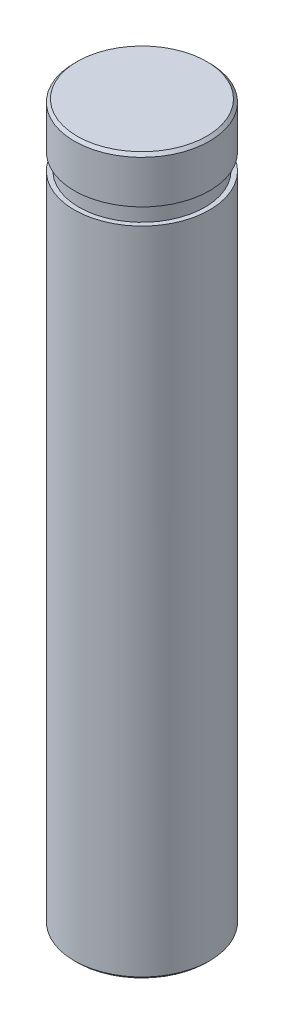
ISO-10303-21;
HEADER;
FILE_DESCRIPTION(('STEP AP214'),'2;1');
FILE_NAME('part.step','',(''),(''),'','','');
FILE_SCHEMA(('AUTOMOTIVE_DESIGN { 1 0 10303 214 1 1 1 1 }'));
ENDSEC;
DATA;
#1=APPLICATION_CONTEXT('core data for automotive mechanical design processes');
#2=APPLICATION_PROTOCOL_DEFINITION('international standard','automotive_design',2000,#1);
#3=PRODUCT_CONTEXT('',#1,'mechanical');
#4=PRODUCT('Part','Part','',(#3));
#5=PRODUCT_RELATED_PRODUCT_CATEGORY('part','',(#4));
#6=PRODUCT_DEFINITION_FORMATION('','',#4);
#7=PRODUCT_DEFINITION_CONTEXT('part definition',#1,'design');
#8=PRODUCT_DEFINITION('design','',#6,#7);
#9=PRODUCT_DEFINITION_SHAPE('','',#8);
#10=(LENGTH_UNIT() NAMED_UNIT(*) SI_UNIT(.MILLI.,.METRE.));
#11=(NAMED_UNIT(*) PLANE_ANGLE_UNIT() SI_UNIT($,.RADIAN.));
#12=(NAMED_UNIT(*) SI_UNIT($,.STERADIAN.) SOLID_ANGLE_UNIT());
#13=UNCERTAINTY_MEASURE_WITH_UNIT(LENGTH_MEASURE(1.E-05),#10,'distance_accuracy_value','');
#14=(GEOMETRIC_REPRESENTATION_CONTEXT(3) GLOBAL_UNCERTAINTY_ASSIGNED_CONTEXT((#13)) GLOBAL_UNIT_ASSIGNED_CONTEXT((#10,
#11,#12)) REPRESENTATION_CONTEXT('',''));
#15=CARTESIAN_POINT('',(0.,0.,0.));
#16=DIRECTION('',(0.,0.,1.));
#17=DIRECTION('',(1.,0.,0.));
#18=AXIS2_PLACEMENT_3D('',#15,#16,#17);
#19=CARTESIAN_POINT('',(0.,0.,0.));
#20=DIRECTION('',(0.,-1.,0.));
#21=DIRECTION('',(0.,0.,-1.));
#22=AXIS2_PLACEMENT_3D('',#19,#20,#21);
#23=PLANE('',#22);
#24=CARTESIAN_POINT('',(0.,0.,0.));
#25=DIRECTION('',(0.,-1.,0.));
#26=DIRECTION('',(0.,0.,-1.));
#27=AXIS2_PLACEMENT_3D('',#24,#25,#26);
#28=CIRCLE('',#27,2.873);
#29=CARTESIAN_POINT('',(0.,0.,-2.873));
#30=VERTEX_POINT('',#29);
#31=EDGE_CURVE('E41',#30,#30,#28,.T.);
#32=ORIENTED_EDGE('',*,*,#31,.T.);
#33=EDGE_LOOP('',(#32));
#34=FACE_BOUND('',#33,.T.);
#35=ADVANCED_FACE('F30',(#34),#23,.T.);
#36=CARTESIAN_POINT('',(0.,0.,0.));
#37=DIRECTION('',(0.,1.,0.));
#38=DIRECTION('',(0.,0.,1.));
#39=AXIS2_PLACEMENT_3D('',#36,#37,#38);
#40=CYLINDRICAL_SURFACE('',#39,3.);
#41=CARTESIAN_POINT('',(0.,0.127000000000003,0.));
#42=DIRECTION('',(0.,-1.,0.));
#43=DIRECTION('',(0.,0.,-1.));
#44=AXIS2_PLACEMENT_3D('',#41,#42,#43);
#45=CIRCLE('',#44,3.);
#46=CARTESIAN_POINT('',(0.,0.127000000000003,-3.));
#47=VERTEX_POINT('',#46);
#48=EDGE_CURVE('E45',#47,#47,#45,.F.);
#49=ORIENTED_EDGE('',*,*,#48,.T.);
#50=EDGE_LOOP('',(#49));
#51=FACE_BOUND('',#50,.T.);
#52=CARTESIAN_POINT('',(0.,28.9814,0.));
#53=DIRECTION('',(0.,1.,0.));
#54=DIRECTION('',(0.,0.,1.));
#55=AXIS2_PLACEMENT_3D('',#52,#53,#54);
#56=CIRCLE('',#55,3.);
#57=CARTESIAN_POINT('',(0.,28.9814,3.));
#58=VERTEX_POINT('',#57);
#59=EDGE_CURVE('E50',#58,#58,#56,.T.);
#60=ORIENTED_EDGE('',*,*,#59,.F.);
#61=EDGE_LOOP('',(#60));
#62=FACE_BOUND('',#61,.T.);
#63=ADVANCED_FACE('F80',(#51,#62),#40,.T.);
#64=CARTESIAN_POINT('',(-3.,28.9814,0.));
#65=DIRECTION('',(0.,1.,0.));
#66=DIRECTION('',(0.,0.,1.));
#67=AXIS2_PLACEMENT_3D('',#64,#65,#66);
#68=PLANE('',#67);
#69=ORIENTED_EDGE('',*,*,#59,.T.);
#70=EDGE_LOOP('',(#69));
#71=FACE_BOUND('',#70,.T.);
#72=CARTESIAN_POINT('',(0.,28.9814,0.));
#73=DIRECTION('',(0.,1.,0.));
#74=DIRECTION('',(0.,0.,1.));
#75=AXIS2_PLACEMENT_3D('',#72,#73,#74);
#76=CIRCLE('',#75,2.794);
#77=CARTESIAN_POINT('',(0.,28.9814,2.794));
#78=VERTEX_POINT('',#77);
#79=EDGE_CURVE('E53',#78,#78,#76,.T.);
#80=ORIENTED_EDGE('',*,*,#79,.F.);
#81=EDGE_LOOP('',(#80));
#82=FACE_BOUND('',#81,.T.);
#83=ADVANCED_FACE('F76',(#71,#82),#68,.T.);
#84=CARTESIAN_POINT('',(0.,0.,0.));
#85=DIRECTION('',(0.,1.,0.));
#86=DIRECTION('',(0.,0.,1.));
#87=AXIS2_PLACEMENT_3D('',#84,#85,#86);
#88=CYLINDRICAL_SURFACE('',#87,2.794);
#89=ORIENTED_EDGE('',*,*,#79,.T.);
#90=EDGE_LOOP('',(#89));
#91=FACE_BOUND('',#90,.T.);
#92=CARTESIAN_POINT('',(0.,29.718,0.));
#93=DIRECTION('',(0.,1.,0.));
#94=DIRECTION('',(0.,0.,1.));
#95=AXIS2_PLACEMENT_3D('',#92,#93,#94);
#96=CIRCLE('',#95,2.794);
#97=CARTESIAN_POINT('',(0.,29.718,2.794));
#98=VERTEX_POINT('',#97);
#99=EDGE_CURVE('E56',#98,#98,#96,.T.);
#100=ORIENTED_EDGE('',*,*,#99,.F.);
#101=EDGE_LOOP('',(#100));
#102=FACE_BOUND('',#101,.T.);
#103=ADVANCED_FACE('F67',(#91,#102),#88,.T.);
#104=CARTESIAN_POINT('',(-2.794,29.718,0.));
#105=DIRECTION('',(0.,-1.,0.));
#106=DIRECTION('',(0.,0.,-1.));
#107=AXIS2_PLACEMENT_3D('',#104,#105,#106);
#108=PLANE('',#107);
#109=ORIENTED_EDGE('',*,*,#99,.T.);
#110=EDGE_LOOP('',(#109));
#111=FACE_BOUND('',#110,.T.);
#112=CARTESIAN_POINT('',(0.,29.718,0.));
#113=DIRECTION('',(0.,1.,0.));
#114=DIRECTION('',(0.,0.,1.));
#115=AXIS2_PLACEMENT_3D('',#112,#113,#114);
#116=CIRCLE('',#115,3.);
#117=CARTESIAN_POINT('',(0.,29.718,3.));
#118=VERTEX_POINT('',#117);
#119=EDGE_CURVE('E59',#118,#118,#116,.T.);
#120=ORIENTED_EDGE('',*,*,#119,.F.);
#121=EDGE_LOOP('',(#120));
#122=FACE_BOUND('',#121,.T.);
#123=ADVANCED_FACE('F65',(#111,#122),#108,.T.);
#124=CARTESIAN_POINT('',(0.,0.,0.));
#125=DIRECTION('',(0.,1.,0.));
#126=DIRECTION('',(0.,0.,1.));
#127=AXIS2_PLACEMENT_3D('',#124,#125,#126);
#128=CYLINDRICAL_SURFACE('',#127,3.);
#129=CARTESIAN_POINT('',(0.,31.623,0.));
#130=DIRECTION('',(0.,1.,0.));
#131=DIRECTION('',(0.,0.,1.));
#132=AXIS2_PLACEMENT_3D('',#129,#130,#131);
#133=CIRCLE('',#132,3.);
#134=CARTESIAN_POINT('',(0.,31.623,3.));
#135=VERTEX_POINT('',#134);
#136=EDGE_CURVE('E10',#135,#135,#133,.F.);
#137=ORIENTED_EDGE('',*,*,#136,.T.);
#138=EDGE_LOOP('',(#137));
#139=FACE_BOUND('',#138,.T.);
#140=ORIENTED_EDGE('',*,*,#119,.T.);
#141=EDGE_LOOP('',(#140));
#142=FACE_BOUND('',#141,.T.);
#143=ADVANCED_FACE('F63',(#139,#142),#128,.T.);
#144=CARTESIAN_POINT('',(-3.,31.75,0.));
#145=DIRECTION('',(0.,1.,0.));
#146=DIRECTION('',(0.,0.,1.));
#147=AXIS2_PLACEMENT_3D('',#144,#145,#146);
#148=PLANE('',#147);
#149=CARTESIAN_POINT('',(0.,31.75,0.));
#150=DIRECTION('',(0.,1.,0.));
#151=DIRECTION('',(0.,0.,1.));
#152=AXIS2_PLACEMENT_3D('',#149,#150,#151);
#153=CIRCLE('',#152,2.873);
#154=CARTESIAN_POINT('',(0.,31.75,2.873));
#155=VERTEX_POINT('',#154);
#156=EDGE_CURVE('E37',#155,#155,#153,.T.);
#157=ORIENTED_EDGE('',*,*,#156,.T.);
#158=EDGE_LOOP('',(#157));
#159=FACE_BOUND('',#158,.T.);
#160=ADVANCED_FACE('F74',(#159),#148,.T.);
#161=CARTESIAN_POINT('',(0.,0.127000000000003,0.));
#162=DIRECTION('',(0.,1.,0.));
#163=DIRECTION('',(0.,0.,1.));
#164=AXIS2_PLACEMENT_3D('',#161,#162,#163);
#165=CONICAL_SURFACE('',#164,3.,0.785398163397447);
#166=ORIENTED_EDGE('',*,*,#31,.F.);
#167=EDGE_LOOP('',(#166));
#168=FACE_BOUND('',#167,.T.);
#169=ORIENTED_EDGE('',*,*,#48,.F.);
#170=EDGE_LOOP('',(#169));
#171=FACE_BOUND('',#170,.T.);
#172=ADVANCED_FACE('F89',(#168,#171),#165,.T.);
#173=CARTESIAN_POINT('',(0.,31.75,0.));
#174=DIRECTION('',(0.,-1.,0.));
#175=DIRECTION('',(0.,0.,-1.));
#176=AXIS2_PLACEMENT_3D('',#173,#174,#175);
#177=CONICAL_SURFACE('',#176,2.873,0.785398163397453);
#178=ORIENTED_EDGE('',*,*,#136,.F.);
#179=EDGE_LOOP('',(#178));
#180=FACE_BOUND('',#179,.T.);
#181=ORIENTED_EDGE('',*,*,#156,.F.);
#182=EDGE_LOOP('',(#181));
#183=FACE_BOUND('',#182,.T.);
#184=ADVANCED_FACE('F32',(#180,#183),#177,.T.);
#185=CLOSED_SHELL('',(#35,#63,#83,#103,#123,#143,#160,#172,#184));
#186=MANIFOLD_SOLID_BREP('B2',#185);
#187=ADVANCED_BREP_SHAPE_REPRESENTATION('',(#18,#186),#14);
#188=SHAPE_DEFINITION_REPRESENTATION(#9,#187);
ENDSEC;
END-ISO-10303-21;
